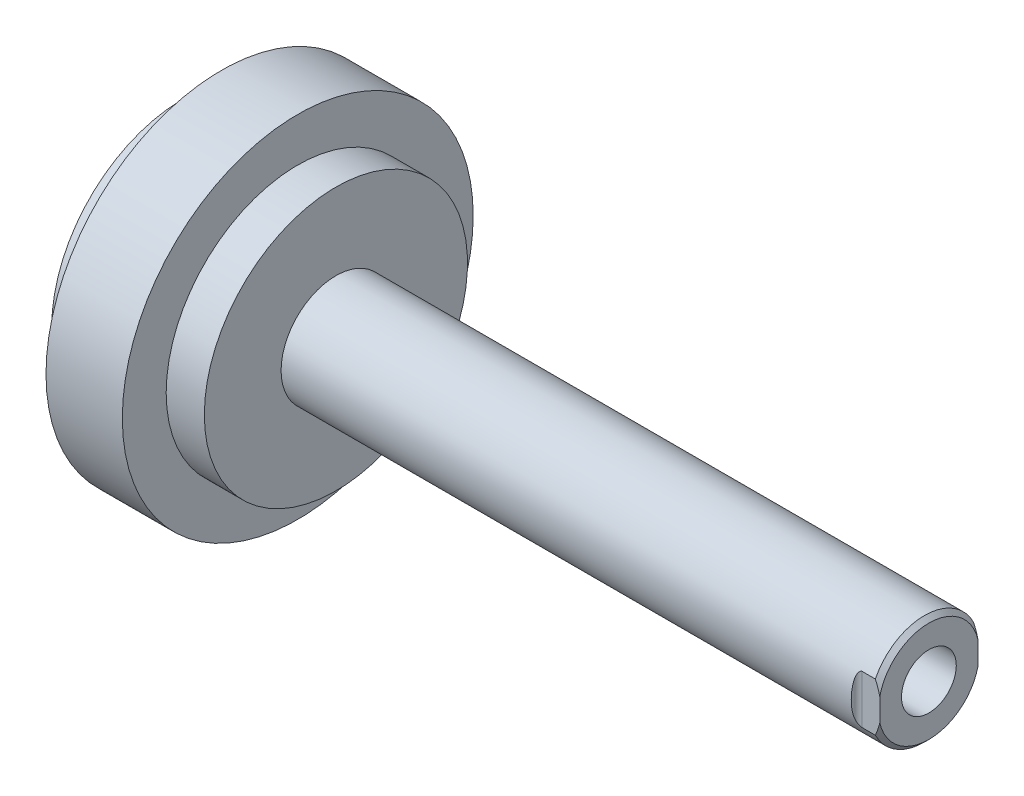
from build123d import *

# Parameters (mm, degrees)
CUT_EXTRUDE1_DEPTH          = 3.302
FILLET3_R                   = 0.762
CHAMFER2_SIZE               = 0.635
F_3_8_16_TAPPED_HOLE1_D     = 7.9375
F_3_8_16_TAPPED_HOLE1_DEPTH = 31.75
F_3_8_16_TAPPED_HOLE1_TIP   = 2.384665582


with BuildPart() as part:
    # Sketch1 → Revolve1 (revolve)
    with BuildSketch(Plane.XY, mode=Mode.PRIVATE) as revolve1_sk:
        Polygon((0, 0), (0, 19.05), (5.5245, 19.05), (5.5245, 25.4), (16.5735, 25.4), (16.5735, 19.05), (22.098, 19.05), (22.098, 7.9375), (107.95, 7.9375), (107.95, 0), align=None)
    revolve(revolve1_sk.sketch.rotate(Axis((0, 0, 0), (1, 0, 0)), 90), axis=Axis((0, 0, 0), (1, 0, 0)))

    # Sketch3 → Cut-Extrude1 (cut)
    with BuildSketch(Plane(origin=(107.95, 0, 0), x_dir=(0, 0, -1), z_dir=(1, 0, 0))):
        with BuildLine():
            Line((-7.112, 3.524679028), (-7.112, -3.524679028))
            ThreePointArc((-7.112, -3.524679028), (-7.9375, 0), (-7.112, 3.524679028))
        make_face()
        with BuildLine():
            Line((7.112, 3.524679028), (7.112, -3.524679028))
            ThreePointArc((7.112, -3.524679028), (7.9375, 0), (7.112, 3.524679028))
        make_face()
    extrude(amount=-CUT_EXTRUDE1_DEPTH, mode=Mode.SUBTRACT)

    # Fillet3
    fillet3_edges = [part.edges().sort_by_distance(p)[0] for p in [
        (104.648, 0, 7.112),
        (104.648, 0, -7.112),
    ]]
    fillet(fillet3_edges, radius=FILLET3_R)

    # Chamfer2
    chamfer2_edges = [part.edges().sort_by_distance(p)[0] for p in [
        (107.95, -7.9375, 0),
        (107.95, 7.9375, 0),
    ]]
    chamfer(chamfer2_edges, length=CHAMFER2_SIZE)

    # 3_8-16 Tapped Hole1
    with Locations(Plane(origin=(107.95, 0.668683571, 2.175880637), x_dir=(0, 0, 1), z_dir=(1, 0, 0))):
        with Locations((-2.175880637, 0.668683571)):
            Hole(F_3_8_16_TAPPED_HOLE1_D / 2, depth=F_3_8_16_TAPPED_HOLE1_DEPTH)
            with Locations((0, 0, -(F_3_8_16_TAPPED_HOLE1_DEPTH + F_3_8_16_TAPPED_HOLE1_TIP / 2))):  # 118° drill point
                Cone(0, F_3_8_16_TAPPED_HOLE1_D / 2, F_3_8_16_TAPPED_HOLE1_TIP, mode=Mode.SUBTRACT)


solid = part.part
